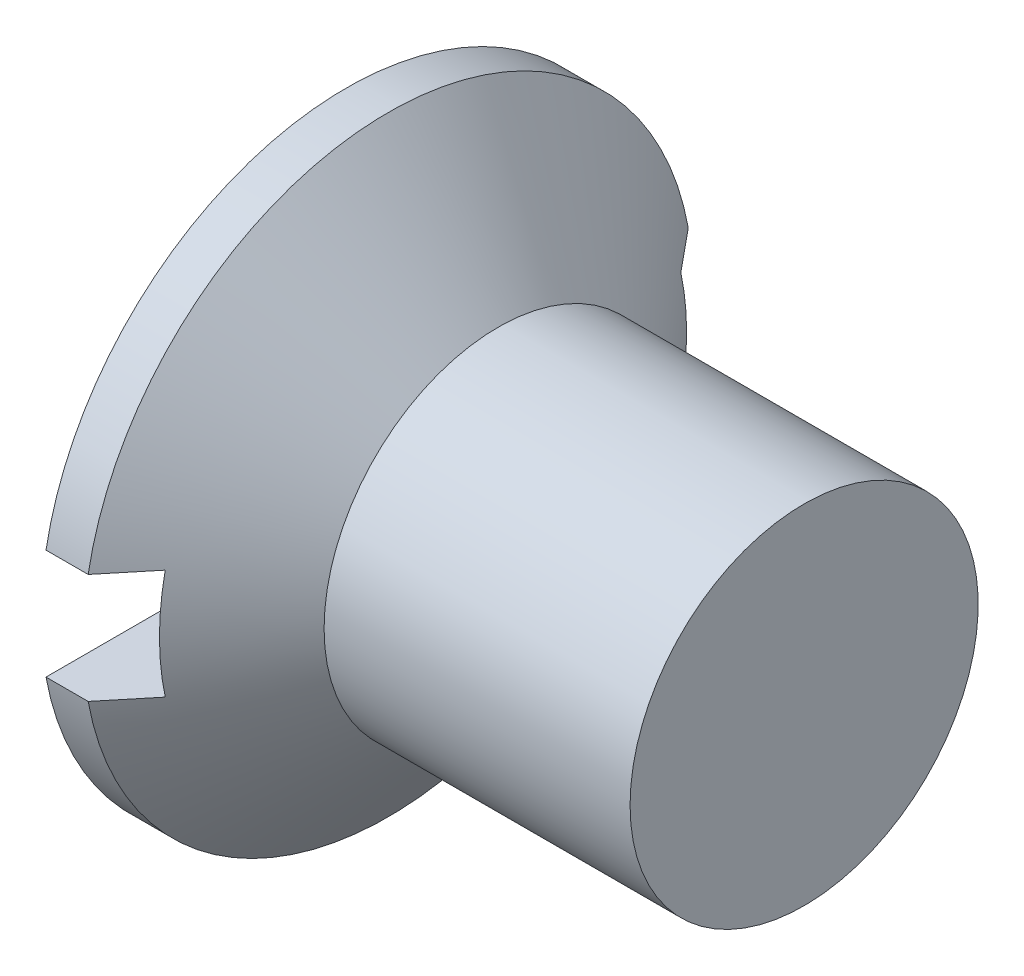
ISO-10303-21;
HEADER;
FILE_DESCRIPTION(('STEP AP214'),'2;1');
FILE_NAME('part.step','',(''),(''),'','','');
FILE_SCHEMA(('AUTOMOTIVE_DESIGN { 1 0 10303 214 1 1 1 1 }'));
ENDSEC;
DATA;
#1=APPLICATION_CONTEXT('core data for automotive mechanical design processes');
#2=APPLICATION_PROTOCOL_DEFINITION('international standard','automotive_design',2000,#1);
#3=PRODUCT_CONTEXT('',#1,'mechanical');
#4=PRODUCT('Part','Part','',(#3));
#5=PRODUCT_RELATED_PRODUCT_CATEGORY('part','',(#4));
#6=PRODUCT_DEFINITION_FORMATION('','',#4);
#7=PRODUCT_DEFINITION_CONTEXT('part definition',#1,'design');
#8=PRODUCT_DEFINITION('design','',#6,#7);
#9=PRODUCT_DEFINITION_SHAPE('','',#8);
#10=(LENGTH_UNIT() NAMED_UNIT(*) SI_UNIT(.MILLI.,.METRE.));
#11=(NAMED_UNIT(*) PLANE_ANGLE_UNIT() SI_UNIT($,.RADIAN.));
#12=(NAMED_UNIT(*) SI_UNIT($,.STERADIAN.) SOLID_ANGLE_UNIT());
#13=UNCERTAINTY_MEASURE_WITH_UNIT(LENGTH_MEASURE(1.E-05),#10,'distance_accuracy_value','');
#14=(GEOMETRIC_REPRESENTATION_CONTEXT(3) GLOBAL_UNCERTAINTY_ASSIGNED_CONTEXT((#13)) GLOBAL_UNIT_ASSIGNED_CONTEXT((#10,
#11,#12)) REPRESENTATION_CONTEXT('',''));
#15=CARTESIAN_POINT('',(0.,0.,0.));
#16=DIRECTION('',(0.,0.,1.));
#17=DIRECTION('',(1.,0.,0.));
#18=AXIS2_PLACEMENT_3D('',#15,#16,#17);
#19=CARTESIAN_POINT('',(1.0668,-0.762000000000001,-4.2291));
#20=DIRECTION('',(1.,0.,0.));
#21=DIRECTION('',(0.,0.,-1.));
#22=AXIS2_PLACEMENT_3D('',#19,#20,#21);
#23=PLANE('',#22);
#24=DIRECTION('',(0.,0.,1.));
#25=VECTOR('',#24,1.);
#26=CARTESIAN_POINT('',(1.0668,-0.457199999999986,-4.2291));
#27=LINE('',#26,#25);
#28=CARTESIAN_POINT('',(1.0668,-0.457200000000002,0.4572));
#29=VERTEX_POINT('',#28);
#30=CARTESIAN_POINT('',(1.0668,-0.457200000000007,2.11727142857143));
#31=VERTEX_POINT('',#30);
#32=EDGE_CURVE('E163',#29,#31,#27,.T.);
#33=ORIENTED_EDGE('',*,*,#32,.F.);
#34=DIRECTION('',(0.,1.,0.));
#35=VECTOR('',#34,1.);
#36=CARTESIAN_POINT('',(1.0668,-0.762,0.4572));
#37=LINE('',#36,#35);
#38=CARTESIAN_POINT('',(1.0668,-0.762000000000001,0.4572));
#39=VERTEX_POINT('',#38);
#40=EDGE_CURVE('E11',#39,#29,#37,.T.);
#41=ORIENTED_EDGE('',*,*,#40,.F.);
#42=DIRECTION('',(0.,0.,1.));
#43=VECTOR('',#42,1.);
#44=CARTESIAN_POINT('',(1.0668,-0.762000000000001,-4.2291));
#45=LINE('',#44,#43);
#46=CARTESIAN_POINT('',(1.0668,-0.762000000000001,3.57375793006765));
#47=VERTEX_POINT('',#46);
#48=EDGE_CURVE('E229',#39,#47,#45,.T.);
#49=ORIENTED_EDGE('',*,*,#48,.T.);
#50=CARTESIAN_POINT('',(1.0668,0.,0.));
#51=DIRECTION('',(1.,0.,0.));
#52=DIRECTION('',(0.,0.,-1.));
#53=AXIS2_PLACEMENT_3D('',#50,#51,#52);
#54=CIRCLE('',#53,3.65409219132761);
#55=CARTESIAN_POINT('',(1.0668,0.762,3.57375793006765));
#56=VERTEX_POINT('',#55);
#57=EDGE_CURVE('E265',#47,#56,#54,.F.);
#58=ORIENTED_EDGE('',*,*,#57,.T.);
#59=DIRECTION('',(0.,0.,-1.));
#60=VECTOR('',#59,1.);
#61=CARTESIAN_POINT('',(1.0668,0.762000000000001,4.2291));
#62=LINE('',#61,#60);
#63=CARTESIAN_POINT('',(1.0668,0.762000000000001,0.4572));
#64=VERTEX_POINT('',#63);
#65=EDGE_CURVE('E226',#56,#64,#62,.T.);
#66=ORIENTED_EDGE('',*,*,#65,.T.);
#67=CARTESIAN_POINT('',(1.0668,0.457199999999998,0.4572));
#68=VERTEX_POINT('',#67);
#69=EDGE_CURVE('E40',#68,#64,#37,.T.);
#70=ORIENTED_EDGE('',*,*,#69,.F.);
#71=DIRECTION('',(0.,0.,-1.));
#72=VECTOR('',#71,1.);
#73=CARTESIAN_POINT('',(1.0668,0.457200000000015,-4.2291));
#74=LINE('',#73,#72);
#75=CARTESIAN_POINT('',(1.0668,0.457199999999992,2.11727142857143));
#76=VERTEX_POINT('',#75);
#77=EDGE_CURVE('E373',#76,#68,#74,.T.);
#78=ORIENTED_EDGE('',*,*,#77,.F.);
#79=DIRECTION('',(0.,1.,0.));
#80=VECTOR('',#79,1.);
#81=CARTESIAN_POINT('',(1.0668,-0.762000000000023,2.11727142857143));
#82=LINE('',#81,#80);
#83=EDGE_CURVE('E317',#31,#76,#82,.T.);
#84=ORIENTED_EDGE('',*,*,#83,.F.);
#85=EDGE_LOOP('',(#33,#41,#49,#58,#66,#70,#78,#84));
#86=FACE_BOUND('',#85,.T.);
#87=ADVANCED_FACE('F32',(#86),#23,.F.);
#88=DIRECTION('',(0.,0.,1.));
#89=VECTOR('',#88,1.);
#90=CARTESIAN_POINT('',(1.0668,-0.457199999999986,-4.2291));
#91=LINE('',#90,#89);
#92=CARTESIAN_POINT('',(1.0668,-0.457199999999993,-2.11727142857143));
#93=VERTEX_POINT('',#92);
#94=CARTESIAN_POINT('',(1.0668,-0.457199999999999,-0.4572));
#95=VERTEX_POINT('',#94);
#96=EDGE_CURVE('E188',#93,#95,#91,.T.);
#97=ORIENTED_EDGE('',*,*,#96,.F.);
#98=DIRECTION('',(0.,-1.,0.));
#99=VECTOR('',#98,1.);
#100=CARTESIAN_POINT('',(1.0668,-0.762000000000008,-2.11727142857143));
#101=LINE('',#100,#99);
#102=CARTESIAN_POINT('',(1.0668,0.457200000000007,-2.11727142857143));
#103=VERTEX_POINT('',#102);
#104=EDGE_CURVE('E367',#103,#93,#101,.T.);
#105=ORIENTED_EDGE('',*,*,#104,.F.);
#106=DIRECTION('',(0.,0.,-1.));
#107=VECTOR('',#106,1.);
#108=CARTESIAN_POINT('',(1.0668,0.457200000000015,-4.2291));
#109=LINE('',#108,#107);
#110=CARTESIAN_POINT('',(1.0668,0.457200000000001,-0.4572));
#111=VERTEX_POINT('',#110);
#112=EDGE_CURVE('E378',#111,#103,#109,.T.);
#113=ORIENTED_EDGE('',*,*,#112,.F.);
#114=DIRECTION('',(0.,-1.,0.));
#115=VECTOR('',#114,1.);
#116=CARTESIAN_POINT('',(1.0668,-0.762000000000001,-0.4572));
#117=LINE('',#116,#115);
#118=CARTESIAN_POINT('',(1.0668,0.762,-0.4572));
#119=VERTEX_POINT('',#118);
#120=EDGE_CURVE('E348',#119,#111,#117,.T.);
#121=ORIENTED_EDGE('',*,*,#120,.F.);
#122=CARTESIAN_POINT('',(1.0668,0.762,-3.57375793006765));
#123=VERTEX_POINT('',#122);
#124=EDGE_CURVE('E54',#119,#123,#62,.T.);
#125=ORIENTED_EDGE('',*,*,#124,.T.);
#126=CARTESIAN_POINT('',(1.0668,-0.762000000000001,-3.57375793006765));
#127=VERTEX_POINT('',#126);
#128=EDGE_CURVE('E262',#123,#127,#54,.F.);
#129=ORIENTED_EDGE('',*,*,#128,.T.);
#130=CARTESIAN_POINT('',(1.0668,-0.762000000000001,-0.4572));
#131=VERTEX_POINT('',#130);
#132=EDGE_CURVE('E230',#127,#131,#45,.T.);
#133=ORIENTED_EDGE('',*,*,#132,.T.);
#134=EDGE_CURVE('E347',#95,#131,#117,.T.);
#135=ORIENTED_EDGE('',*,*,#134,.F.);
#136=EDGE_LOOP('',(#97,#105,#113,#121,#125,#129,#133,#135));
#137=FACE_BOUND('',#136,.T.);
#138=ADVANCED_FACE('F310',(#137),#23,.F.);
#139=CARTESIAN_POINT('',(4.11816176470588,0.,0.239245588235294));
#140=DIRECTION('',(-0.0712470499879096,0.,-0.997458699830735));
#141=DIRECTION('',(-0.997458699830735,0.,0.0712470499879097));
#142=AXIS2_PLACEMENT_3D('',#139,#140,#141);
#143=PLANE('',#142);
#144=ORIENTED_EDGE('',*,*,#40,.T.);
#145=DIRECTION('',(0.994936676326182,0.0710669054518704,-0.0710669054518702));
#146=VECTOR('',#145,1.);
#147=CARTESIAN_POINT('',(4.13507811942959,-0.238037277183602,0.238037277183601));
#148=LINE('',#147,#146);
#149=CARTESIAN_POINT('',(3.7338,-0.266700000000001,0.266699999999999));
#150=VERTEX_POINT('',#149);
#151=EDGE_CURVE('E161',#29,#150,#148,.T.);
#152=ORIENTED_EDGE('',*,*,#151,.T.);
#153=DIRECTION('',(0.820177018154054,0.569102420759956,-0.0585840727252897));
#154=VECTOR('',#153,1.);
#155=CARTESIAN_POINT('',(0.,-2.8575,0.533400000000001));
#156=LINE('',#155,#154);
#157=CARTESIAN_POINT('',(0.,-2.8575,0.533400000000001));
#158=VERTEX_POINT('',#157);
#159=EDGE_CURVE('E185',#158,#150,#156,.T.);
#160=ORIENTED_EDGE('',*,*,#159,.F.);
#161=DIRECTION('',(0.,-1.,0.));
#162=VECTOR('',#161,1.);
#163=CARTESIAN_POINT('',(0.,2.8575,0.5334));
#164=LINE('',#163,#162);
#165=CARTESIAN_POINT('',(0.,-0.762000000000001,0.5334));
#166=VERTEX_POINT('',#165);
#167=EDGE_CURVE('E324',#166,#158,#164,.T.);
#168=ORIENTED_EDGE('',*,*,#167,.F.);
#169=DIRECTION('',(0.997458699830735,0.,-0.0712470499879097));
#170=VECTOR('',#169,1.);
#171=CARTESIAN_POINT('',(1.39983654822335,-0.762000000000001,0.433411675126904));
#172=LINE('',#171,#170);
#173=EDGE_CURVE('E221',#166,#39,#172,.T.);
#174=ORIENTED_EDGE('',*,*,#173,.T.);
#175=EDGE_LOOP('',(#144,#152,#160,#168,#174));
#176=FACE_BOUND('',#175,.T.);
#177=ADVANCED_FACE('F183',(#176),#143,.T.);
#178=DIRECTION('',(0.820177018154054,-0.569102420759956,-0.0585840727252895));
#179=VECTOR('',#178,1.);
#180=CARTESIAN_POINT('',(0.,2.8575,0.5334));
#181=LINE('',#180,#179);
#182=CARTESIAN_POINT('',(0.,2.8575,0.5334));
#183=VERTEX_POINT('',#182);
#184=CARTESIAN_POINT('',(3.7338,0.2667,0.2667));
#185=VERTEX_POINT('',#184);
#186=EDGE_CURVE('E208',#183,#185,#181,.T.);
#187=ORIENTED_EDGE('',*,*,#186,.T.);
#188=DIRECTION('',(-0.994936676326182,0.0710669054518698,0.0710669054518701));
#189=VECTOR('',#188,1.);
#190=CARTESIAN_POINT('',(4.13507811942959,0.2380372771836,0.238037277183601));
#191=LINE('',#190,#189);
#192=EDGE_CURVE('E375',#185,#68,#191,.T.);
#193=ORIENTED_EDGE('',*,*,#192,.T.);
#194=ORIENTED_EDGE('',*,*,#69,.T.);
#195=DIRECTION('',(-0.997458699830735,0.,0.0712470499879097));
#196=VECTOR('',#195,1.);
#197=CARTESIAN_POINT('',(0.798746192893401,0.762,0.476346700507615));
#198=LINE('',#197,#196);
#199=CARTESIAN_POINT('',(0.,0.762,0.5334));
#200=VERTEX_POINT('',#199);
#201=EDGE_CURVE('E223',#64,#200,#198,.T.);
#202=ORIENTED_EDGE('',*,*,#201,.T.);
#203=EDGE_CURVE('E325',#183,#200,#164,.T.);
#204=ORIENTED_EDGE('',*,*,#203,.F.);
#205=EDGE_LOOP('',(#187,#193,#194,#202,#204));
#206=FACE_BOUND('',#205,.T.);
#207=ADVANCED_FACE('F411',(#206),#143,.T.);
#208=CARTESIAN_POINT('',(4.11816176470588,0.,-0.239245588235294));
#209=DIRECTION('',(-0.0712470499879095,0.,0.997458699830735));
#210=DIRECTION('',(0.997458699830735,0.,0.0712470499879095));
#211=AXIS2_PLACEMENT_3D('',#208,#209,#210);
#212=PLANE('',#211);
#213=DIRECTION('',(0.820177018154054,0.569102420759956,0.0585840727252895));
#214=VECTOR('',#213,1.);
#215=CARTESIAN_POINT('',(0.,-2.8575,-0.5334));
#216=LINE('',#215,#214);
#217=CARTESIAN_POINT('',(0.,-2.8575,-0.5334));
#218=VERTEX_POINT('',#217);
#219=CARTESIAN_POINT('',(3.7338,-0.2667,-0.2667));
#220=VERTEX_POINT('',#219);
#221=EDGE_CURVE('E203',#218,#220,#216,.T.);
#222=ORIENTED_EDGE('',*,*,#221,.T.);
#223=DIRECTION('',(-0.994936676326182,-0.0710669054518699,-0.07106690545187));
#224=VECTOR('',#223,1.);
#225=CARTESIAN_POINT('',(4.13507811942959,-0.2380372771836,-0.238037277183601));
#226=LINE('',#225,#224);
#227=EDGE_CURVE('E364',#220,#95,#226,.T.);
#228=ORIENTED_EDGE('',*,*,#227,.T.);
#229=ORIENTED_EDGE('',*,*,#134,.T.);
#230=DIRECTION('',(-0.997458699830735,0.,-0.0712470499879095));
#231=VECTOR('',#230,1.);
#232=CARTESIAN_POINT('',(0.798746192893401,-0.762000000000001,-0.476346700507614));
#233=LINE('',#232,#231);
#234=CARTESIAN_POINT('',(0.,-0.762000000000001,-0.5334));
#235=VERTEX_POINT('',#234);
#236=EDGE_CURVE('E218',#131,#235,#233,.T.);
#237=ORIENTED_EDGE('',*,*,#236,.T.);
#238=DIRECTION('',(0.,1.,0.));
#239=VECTOR('',#238,1.);
#240=CARTESIAN_POINT('',(0.,-2.8575,-0.5334));
#241=LINE('',#240,#239);
#242=EDGE_CURVE('E206',#218,#235,#241,.T.);
#243=ORIENTED_EDGE('',*,*,#242,.F.);
#244=EDGE_LOOP('',(#222,#228,#229,#237,#243));
#245=FACE_BOUND('',#244,.T.);
#246=ADVANCED_FACE('F361',(#245),#212,.T.);
#247=ORIENTED_EDGE('',*,*,#120,.T.);
#248=DIRECTION('',(0.994936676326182,-0.0710669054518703,0.07106690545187));
#249=VECTOR('',#248,1.);
#250=CARTESIAN_POINT('',(4.13507811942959,0.238037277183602,-0.238037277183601));
#251=LINE('',#250,#249);
#252=CARTESIAN_POINT('',(3.7338,0.266700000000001,-0.266699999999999));
#253=VERTEX_POINT('',#252);
#254=EDGE_CURVE('E380',#111,#253,#251,.T.);
#255=ORIENTED_EDGE('',*,*,#254,.T.);
#256=DIRECTION('',(0.820177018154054,-0.569102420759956,0.0585840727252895));
#257=VECTOR('',#256,1.);
#258=CARTESIAN_POINT('',(0.,2.8575,-0.533399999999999));
#259=LINE('',#258,#257);
#260=CARTESIAN_POINT('',(0.,2.8575,-0.533399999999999));
#261=VERTEX_POINT('',#260);
#262=EDGE_CURVE('E197',#261,#253,#259,.T.);
#263=ORIENTED_EDGE('',*,*,#262,.F.);
#264=CARTESIAN_POINT('',(0.,0.762,-0.5334));
#265=VERTEX_POINT('',#264);
#266=EDGE_CURVE('E202',#265,#261,#241,.T.);
#267=ORIENTED_EDGE('',*,*,#266,.F.);
#268=DIRECTION('',(0.997458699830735,0.,0.0712470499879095));
#269=VECTOR('',#268,1.);
#270=CARTESIAN_POINT('',(1.39983654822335,0.762,-0.433411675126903));
#271=LINE('',#270,#269);
#272=EDGE_CURVE('E47',#265,#119,#271,.T.);
#273=ORIENTED_EDGE('',*,*,#272,.T.);
#274=EDGE_LOOP('',(#247,#255,#263,#267,#273));
#275=FACE_BOUND('',#274,.T.);
#276=ADVANCED_FACE('F414',(#275),#212,.T.);
#277=CARTESIAN_POINT('',(0.,0.,0.));
#278=DIRECTION('',(-1.,0.,0.));
#279=DIRECTION('',(0.,0.,1.));
#280=AXIS2_PLACEMENT_3D('',#277,#278,#279);
#281=PLANE('',#280);
#282=DIRECTION('',(0.,0.,1.));
#283=VECTOR('',#282,1.);
#284=CARTESIAN_POINT('',(0.,2.8575,-0.533399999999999));
#285=LINE('',#284,#283);
#286=EDGE_CURVE('E321',#261,#183,#285,.T.);
#287=ORIENTED_EDGE('',*,*,#286,.T.);
#288=ORIENTED_EDGE('',*,*,#203,.T.);
#289=DIRECTION('',(0.,0.,-1.));
#290=VECTOR('',#289,1.);
#291=CARTESIAN_POINT('',(0.,0.762000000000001,4.2291));
#292=LINE('',#291,#290);
#293=CARTESIAN_POINT('',(0.,0.762000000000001,4.15988495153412));
#294=VERTEX_POINT('',#293);
#295=EDGE_CURVE('E234',#294,#200,#292,.T.);
#296=ORIENTED_EDGE('',*,*,#295,.F.);
#297=CARTESIAN_POINT('',(0.,0.,0.));
#298=DIRECTION('',(-1.,0.,0.));
#299=DIRECTION('',(0.,0.,1.));
#300=AXIS2_PLACEMENT_3D('',#297,#298,#299);
#301=CIRCLE('',#300,4.2291);
#302=CARTESIAN_POINT('',(0.,0.761999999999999,-4.15988495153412));
#303=VERTEX_POINT('',#302);
#304=EDGE_CURVE('E261',#294,#303,#301,.T.);
#305=ORIENTED_EDGE('',*,*,#304,.T.);
#306=EDGE_CURVE('E225',#265,#303,#292,.T.);
#307=ORIENTED_EDGE('',*,*,#306,.F.);
#308=ORIENTED_EDGE('',*,*,#266,.T.);
#309=EDGE_LOOP('',(#287,#288,#296,#305,#307,#308));
#310=FACE_BOUND('',#309,.T.);
#311=ADVANCED_FACE('F34',(#310),#281,.T.);
#312=DIRECTION('',(0.,0.,1.));
#313=VECTOR('',#312,1.);
#314=CARTESIAN_POINT('',(0.,-0.762000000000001,-4.2291));
#315=LINE('',#314,#313);
#316=CARTESIAN_POINT('',(0.,-0.762000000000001,4.15988495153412));
#317=VERTEX_POINT('',#316);
#318=EDGE_CURVE('E237',#166,#317,#315,.T.);
#319=ORIENTED_EDGE('',*,*,#318,.F.);
#320=ORIENTED_EDGE('',*,*,#167,.T.);
#321=DIRECTION('',(0.,0.,-1.));
#322=VECTOR('',#321,1.);
#323=CARTESIAN_POINT('',(0.,-2.8575,0.533400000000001));
#324=LINE('',#323,#322);
#325=EDGE_CURVE('E201',#158,#218,#324,.T.);
#326=ORIENTED_EDGE('',*,*,#325,.T.);
#327=ORIENTED_EDGE('',*,*,#242,.T.);
#328=CARTESIAN_POINT('',(0.,-0.762000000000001,-4.15988495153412));
#329=VERTEX_POINT('',#328);
#330=EDGE_CURVE('E238',#329,#235,#315,.T.);
#331=ORIENTED_EDGE('',*,*,#330,.F.);
#332=EDGE_CURVE('E258',#329,#317,#301,.T.);
#333=ORIENTED_EDGE('',*,*,#332,.T.);
#334=EDGE_LOOP('',(#319,#320,#326,#327,#331,#333));
#335=FACE_BOUND('',#334,.T.);
#336=ADVANCED_FACE('F295',(#335),#281,.T.);
#337=CARTESIAN_POINT('',(1.0668,0.762000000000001,4.2291));
#338=DIRECTION('',(0.,1.,0.));
#339=DIRECTION('',(0.,0.,1.));
#340=AXIS2_PLACEMENT_3D('',#337,#338,#339);
#341=PLANE('',#340);
#342=ORIENTED_EDGE('',*,*,#201,.F.);
#343=ORIENTED_EDGE('',*,*,#65,.F.);
#344=CARTESIAN_POINT('',(-3.7072587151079,0.761999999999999,-9.31247020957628));
#345=CARTESIAN_POINT('',(-3.44000396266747,0.761999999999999,-8.99289524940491));
#346=CARTESIAN_POINT('',(-3.17279503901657,0.761999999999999,-8.67328191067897));
#347=CARTESIAN_POINT('',(-2.63848754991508,0.761999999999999,-8.03388044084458));
#348=CARTESIAN_POINT('',(-2.37138900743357,0.761999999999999,-7.71409229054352));
#349=CARTESIAN_POINT('',(-1.83662954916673,0.761999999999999,-7.07341451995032));
#350=CARTESIAN_POINT('',(-1.56896924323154,0.761999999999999,-6.75252439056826));
#351=CARTESIAN_POINT('',(-1.03400782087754,0.761999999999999,-6.11052642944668));
#352=CARTESIAN_POINT('',(-0.766706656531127,0.761999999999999,-5.78941863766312));
#353=CARTESIAN_POINT('',(-0.351016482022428,0.761999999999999,-5.289228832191));
#354=CARTESIAN_POINT('',(-0.202447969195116,0.761999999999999,-5.11029601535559));
#355=CARTESIAN_POINT('',(0.0944702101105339,0.761999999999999,-4.75224397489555));
#356=CARTESIAN_POINT('',(0.242819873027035,0.761999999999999,-4.57312474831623));
#357=CARTESIAN_POINT('',(0.539280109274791,0.761999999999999,-4.21454388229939));
#358=CARTESIAN_POINT('',(0.687390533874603,0.761999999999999,-4.03508211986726));
#359=CARTESIAN_POINT('',(0.983148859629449,0.761999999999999,-3.6757952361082));
#360=CARTESIAN_POINT('',(1.1307967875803,0.762,-3.49597013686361));
#361=CARTESIAN_POINT('',(1.4250784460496,0.762,-3.1361172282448));
#362=CARTESIAN_POINT('',(1.57171364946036,0.762,-2.95609062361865));
#363=CARTESIAN_POINT('',(1.8638632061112,0.762,-2.5950604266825));
#364=CARTESIAN_POINT('',(2.00937730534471,0.762,-2.41405662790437));
#365=CARTESIAN_POINT('',(2.22594109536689,0.762,-2.14132570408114));
#366=CARTESIAN_POINT('',(2.29781283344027,0.762,-2.05025202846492));
#367=CARTESIAN_POINT('',(2.44075137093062,0.762,-1.8674759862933));
#368=CARTESIAN_POINT('',(2.51181818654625,0.762,-1.77577363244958));
#369=CARTESIAN_POINT('',(2.65270923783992,0.762,-1.59146944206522));
#370=CARTESIAN_POINT('',(2.72253390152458,0.762,-1.49886793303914));
#371=CARTESIAN_POINT('',(2.86023102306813,0.762,-1.31222787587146));
#372=CARTESIAN_POINT('',(2.92810378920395,0.762,-1.2181895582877));
#373=CARTESIAN_POINT('',(3.01025299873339,0.762,-1.09986139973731));
#374=CARTESIAN_POINT('',(3.02617193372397,0.762,-1.07671297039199));
#375=CARTESIAN_POINT('',(3.05776361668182,0.762,-1.03024803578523));
#376=CARTESIAN_POINT('',(3.07343635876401,0.762,-1.0069315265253));
#377=CARTESIAN_POINT('',(3.12003064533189,0.762,-0.936688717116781));
#378=CARTESIAN_POINT('',(3.15052357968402,0.762,-0.889475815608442));
#379=CARTESIAN_POINT('',(3.20988876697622,0.762,-0.79404861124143));
#380=CARTESIAN_POINT('',(3.23876139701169,0.762,-0.745834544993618));
#381=CARTESIAN_POINT('',(3.29412788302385,0.762,-0.648063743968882));
#382=CARTESIAN_POINT('',(3.32062251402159,0.762,-0.598507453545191));
#383=CARTESIAN_POINT('',(3.37465775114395,0.762,-0.488263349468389));
#384=CARTESIAN_POINT('',(3.40148165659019,0.762,-0.427215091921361));
#385=CARTESIAN_POINT('',(3.44672648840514,0.762,-0.302131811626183));
#386=CARTESIAN_POINT('',(3.46518411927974,0.762,-0.238111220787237));
#387=CARTESIAN_POINT('',(3.48225148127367,0.762,-0.146253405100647));
#388=CARTESIAN_POINT('',(3.48614457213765,0.762,-0.119389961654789));
#389=CARTESIAN_POINT('',(3.49159277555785,0.762,-0.0654330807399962));
#390=CARTESIAN_POINT('',(3.49314897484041,0.762,-0.038339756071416));
#391=CARTESIAN_POINT('',(3.49381884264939,0.762,0.0158555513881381));
#392=CARTESIAN_POINT('',(3.49293454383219,0.762,0.0429575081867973));
#393=CARTESIAN_POINT('',(3.48879300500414,0.762,0.0969771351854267));
#394=CARTESIAN_POINT('',(3.48553530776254,0.762,0.123894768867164));
#395=CARTESIAN_POINT('',(3.46943887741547,0.762,0.222717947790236));
#396=CARTESIAN_POINT('',(3.44971992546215,0.762,0.293536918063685));
#397=CARTESIAN_POINT('',(3.41248463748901,0.762,0.396952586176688));
#398=CARTESIAN_POINT('',(3.39872406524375,0.762,0.431090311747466));
#399=CARTESIAN_POINT('',(3.36925376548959,0.762,0.498521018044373));
#400=CARTESIAN_POINT('',(3.35354458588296,0.762,0.531814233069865));
#401=CARTESIAN_POINT('',(3.31943027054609,0.762,0.600099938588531));
#402=CARTESIAN_POINT('',(3.30091151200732,0.762,0.635034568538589));
#403=CARTESIAN_POINT('',(3.26259798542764,0.762,0.704200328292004));
#404=CARTESIAN_POINT('',(3.24280301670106,0.762,0.738431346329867));
#405=CARTESIAN_POINT('',(3.18195487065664,0.762,0.840317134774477));
#406=CARTESIAN_POINT('',(3.13946655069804,0.762,0.907110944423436));
#407=CARTESIAN_POINT('',(3.05209649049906,0.762,1.03933825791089));
#408=CARTESIAN_POINT('',(3.0072087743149,0.762,1.10476774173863));
#409=CARTESIAN_POINT('',(2.91593893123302,0.762,1.23458285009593));
#410=CARTESIAN_POINT('',(2.86955664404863,0.762,1.29896836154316));
#411=CARTESIAN_POINT('',(2.77564303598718,0.762,1.42719101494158));
#412=CARTESIAN_POINT('',(2.72810866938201,0.762,1.49102591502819));
#413=CARTESIAN_POINT('',(2.63231739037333,0.762,1.61816085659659));
#414=CARTESIAN_POINT('',(2.58406040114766,0.762,1.68146084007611));
#415=CARTESIAN_POINT('',(2.48711166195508,0.762,1.80754005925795));
#416=CARTESIAN_POINT('',(2.4384208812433,0.762,1.8703200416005));
#417=CARTESIAN_POINT('',(2.34064642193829,0.762,1.99556913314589));
#418=CARTESIAN_POINT('',(2.2915627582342,0.762,2.05803825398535));
#419=CARTESIAN_POINT('',(2.14505428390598,0.762,2.24357793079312));
#420=CARTESIAN_POINT('',(2.04719301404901,0.762,2.36630365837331));
#421=CARTESIAN_POINT('',(1.8507288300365,0.762,2.61116041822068));
#422=CARTESIAN_POINT('',(1.75212590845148,0.762,2.73329144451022));
#423=CARTESIAN_POINT('',(1.45557279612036,0.762,3.09909678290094));
#424=CARTESIAN_POINT('',(1.2568860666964,0.762,3.34217356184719));
#425=CARTESIAN_POINT('',(0.858371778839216,0.762,3.82769147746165));
#426=CARTESIAN_POINT('',(0.658543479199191,0.762000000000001,4.07013200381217));
#427=CARTESIAN_POINT('',(0.258296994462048,0.762000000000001,4.55451731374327));
#428=CARTESIAN_POINT('',(0.0578788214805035,0.762000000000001,4.79646210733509));
#429=CARTESIAN_POINT('',(-0.342651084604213,0.762000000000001,5.27922139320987));
#430=CARTESIAN_POINT('',(-0.542761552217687,0.762000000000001,5.52003693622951));
#431=CARTESIAN_POINT('',(-0.943235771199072,0.762000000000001,6.0014594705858));
#432=CARTESIAN_POINT('',(-1.14359952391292,0.762000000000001,6.24206646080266));
#433=CARTESIAN_POINT('',(-1.74487446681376,0.762000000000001,6.96357581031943));
#434=CARTESIAN_POINT('',(-2.14604716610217,0.762000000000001,7.44426021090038));
#435=CARTESIAN_POINT('',(-2.64396767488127,0.762000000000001,8.04039269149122));
#436=CARTESIAN_POINT('',(-2.74053815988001,0.762000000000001,8.15598900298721));
#437=CARTESIAN_POINT('',(-2.93370243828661,0.762000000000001,8.38716828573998));
#438=CARTESIAN_POINT('',(-3.03029623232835,0.762000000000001,8.50275125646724));
#439=CARTESIAN_POINT('',(-3.22361055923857,0.762000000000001,8.73403297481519));
#440=CARTESIAN_POINT('',(-3.3203311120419,0.762000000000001,8.84973170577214));
#441=CARTESIAN_POINT('',(-3.51378501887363,0.762000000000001,9.08111230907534));
#442=CARTESIAN_POINT('',(-3.61051837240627,0.762000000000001,9.19679418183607));
#443=CARTESIAN_POINT('',(-3.7072587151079,0.762000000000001,9.31247020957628));
#444=B_SPLINE_CURVE_WITH_KNOTS('',3,(#344,#345,#346,#347,#348,#349,#350,#351,#352,#353,#354,
#355,#356,#357,#358,#359,#360,#361,#362,#363,#364,#365,#366,#367,#368,#369,#370,#371,#372,#373,
#374,#375,#376,#377,#378,#379,#380,#381,#382,#383,#384,#385,#386,#387,#388,#389,#390,#391,#392,
#393,#394,#395,#396,#397,#398,#399,#400,#401,#402,#403,#404,#405,#406,#407,#408,#409,#410,#411,
#412,#413,#414,#415,#416,#417,#418,#419,#420,#421,#422,#423,#424,#425,#426,#427,#428,#429,#430,
#431,#432,#433,#434,#435,#436,#437,#438,#439,#440,#441,#442,#443),.UNSPECIFIED.,.F.,.F.,(4,2,2,
2,2,2,2,2,2,2,2,2,2,2,2,2,2,2,2,2,2,2,2,2,2,2,2,2,2,2,2,2,2,2,2,2,2,2,2,2,2,2,2,2,2,2,2,2,2,4),
(0.,1.24979177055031,2.49977364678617,3.75337340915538,5.00678480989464,5.70449953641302,
6.40222549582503,7.10028597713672,7.79830523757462,8.49486886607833,9.19158592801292,
9.53963455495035,9.88767616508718,10.2355954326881,10.5834594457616,10.6677394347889,
10.7520214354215,10.9206098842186,11.0891589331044,11.2576528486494,11.4573840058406,
11.6562302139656,11.7375735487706,11.8188790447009,11.9001168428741,11.9813702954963,
12.2003589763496,12.3107660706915,12.4211421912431,12.5397301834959,12.6583368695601,
12.8957317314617,13.1337482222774,13.3717903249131,13.6105509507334,13.8493371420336,
14.0876816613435,14.3260171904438,14.7969108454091,15.2678092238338,16.2096435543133,
17.1521812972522,18.0946998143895,19.0340222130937,19.9733496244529,21.8516391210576,
22.3035188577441,22.7554127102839,23.207816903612,23.6602069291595),.UNSPECIFIED.);
#445=CARTESIAN_POINT('',(0.584311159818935,0.762000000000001,4.15988495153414));
#446=VERTEX_POINT('',#445);
#447=EDGE_CURVE('E341',#56,#446,#444,.T.);
#448=ORIENTED_EDGE('',*,*,#447,.T.);
#449=DIRECTION('',(-1.,0.,0.));
#450=VECTOR('',#449,1.);
#451=CARTESIAN_POINT('',(-6.34999999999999,0.762000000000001,4.15988495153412));
#452=LINE('',#451,#450);
#453=EDGE_CURVE('E244',#446,#294,#452,.T.);
#454=ORIENTED_EDGE('',*,*,#453,.T.);
#455=ORIENTED_EDGE('',*,*,#295,.T.);
#456=EDGE_LOOP('',(#342,#343,#448,#454,#455));
#457=FACE_BOUND('',#456,.T.);
#458=ADVANCED_FACE('F291',(#457),#341,.F.);
#459=ORIENTED_EDGE('',*,*,#272,.F.);
#460=ORIENTED_EDGE('',*,*,#306,.T.);
#461=DIRECTION('',(-1.,0.,0.));
#462=VECTOR('',#461,1.);
#463=CARTESIAN_POINT('',(-6.34999999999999,0.761999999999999,-4.15988495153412));
#464=LINE('',#463,#462);
#465=CARTESIAN_POINT('',(0.584311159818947,0.761999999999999,-4.15988495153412));
#466=VERTEX_POINT('',#465);
#467=EDGE_CURVE('E246',#303,#466,#464,.F.);
#468=ORIENTED_EDGE('',*,*,#467,.T.);
#469=EDGE_CURVE('E273',#466,#123,#444,.T.);
#470=ORIENTED_EDGE('',*,*,#469,.T.);
#471=ORIENTED_EDGE('',*,*,#124,.F.);
#472=EDGE_LOOP('',(#459,#460,#468,#470,#471));
#473=FACE_BOUND('',#472,.T.);
#474=ADVANCED_FACE('F288',(#473),#341,.F.);
#475=CARTESIAN_POINT('',(1.0668,-0.762000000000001,-4.2291));
#476=DIRECTION('',(0.,-1.,0.));
#477=DIRECTION('',(0.,0.,-1.));
#478=AXIS2_PLACEMENT_3D('',#475,#476,#477);
#479=PLANE('',#478);
#480=ORIENTED_EDGE('',*,*,#173,.F.);
#481=ORIENTED_EDGE('',*,*,#318,.T.);
#482=DIRECTION('',(-1.,0.,0.));
#483=VECTOR('',#482,1.);
#484=CARTESIAN_POINT('',(-6.34999999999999,-0.762000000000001,4.15988495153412));
#485=LINE('',#484,#483);
#486=CARTESIAN_POINT('',(0.584311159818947,-0.762000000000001,4.15988495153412));
#487=VERTEX_POINT('',#486);
#488=EDGE_CURVE('E242',#317,#487,#485,.F.);
#489=ORIENTED_EDGE('',*,*,#488,.T.);
#490=CARTESIAN_POINT('',(-3.7072587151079,-0.762,9.31247020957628));
#491=CARTESIAN_POINT('',(-3.44000396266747,-0.762,8.99289524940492));
#492=CARTESIAN_POINT('',(-3.17279503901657,-0.762,8.67328191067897));
#493=CARTESIAN_POINT('',(-2.63848754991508,-0.762,8.03388044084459));
#494=CARTESIAN_POINT('',(-2.37138900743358,-0.762,7.71409229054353));
#495=CARTESIAN_POINT('',(-1.83662954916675,-0.762,7.07341451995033));
#496=CARTESIAN_POINT('',(-1.56896924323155,-0.762,6.75252439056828));
#497=CARTESIAN_POINT('',(-1.03400782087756,-0.762,6.1105264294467));
#498=CARTESIAN_POINT('',(-0.766706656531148,-0.762000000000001,5.78941863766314));
#499=CARTESIAN_POINT('',(-0.351016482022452,-0.762000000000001,5.28922883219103));
#500=CARTESIAN_POINT('',(-0.202447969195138,-0.762000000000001,5.11029601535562));
#501=CARTESIAN_POINT('',(0.0944702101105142,-0.762000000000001,4.75224397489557));
#502=CARTESIAN_POINT('',(0.242819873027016,-0.762000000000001,4.57312474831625));
#503=CARTESIAN_POINT('',(0.539280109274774,-0.762000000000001,4.21454388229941));
#504=CARTESIAN_POINT('',(0.687390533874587,-0.762000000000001,4.03508211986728));
#505=CARTESIAN_POINT('',(0.983148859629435,-0.762000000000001,3.67579523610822));
#506=CARTESIAN_POINT('',(1.13079678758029,-0.762000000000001,3.49597013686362));
#507=CARTESIAN_POINT('',(1.42507844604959,-0.762000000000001,3.13611722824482));
#508=CARTESIAN_POINT('',(1.57171364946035,-0.762000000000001,2.95609062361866));
#509=CARTESIAN_POINT('',(1.86386320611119,-0.762000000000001,2.59506042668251));
#510=CARTESIAN_POINT('',(2.0093773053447,-0.762,2.41405662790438));
#511=CARTESIAN_POINT('',(2.22594109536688,-0.762000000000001,2.14132570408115));
#512=CARTESIAN_POINT('',(2.29781283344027,-0.762000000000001,2.05025202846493));
#513=CARTESIAN_POINT('',(2.44075137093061,-0.762000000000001,1.86747598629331));
#514=CARTESIAN_POINT('',(2.51181818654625,-0.762000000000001,1.77577363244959));
#515=CARTESIAN_POINT('',(2.65270923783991,-0.762000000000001,1.59146944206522));
#516=CARTESIAN_POINT('',(2.72253390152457,-0.762000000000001,1.49886793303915));
#517=CARTESIAN_POINT('',(2.86023102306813,-0.762000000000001,1.31222787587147));
#518=CARTESIAN_POINT('',(2.92810378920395,-0.762000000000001,1.2181895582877));
#519=CARTESIAN_POINT('',(3.01025299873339,-0.762000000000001,1.09986139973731));
#520=CARTESIAN_POINT('',(3.02617193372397,-0.762000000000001,1.07671297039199));
#521=CARTESIAN_POINT('',(3.05776361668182,-0.762000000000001,1.03024803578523));
#522=CARTESIAN_POINT('',(3.07343635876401,-0.762000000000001,1.00693152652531));
#523=CARTESIAN_POINT('',(3.12003064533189,-0.762000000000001,0.936688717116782));
#524=CARTESIAN_POINT('',(3.15052357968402,-0.762000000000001,0.889475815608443));
#525=CARTESIAN_POINT('',(3.20988876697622,-0.762000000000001,0.79404861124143));
#526=CARTESIAN_POINT('',(3.23876139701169,-0.762000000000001,0.745834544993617));
#527=CARTESIAN_POINT('',(3.29412788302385,-0.762000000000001,0.648063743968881));
#528=CARTESIAN_POINT('',(3.32062251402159,-0.762000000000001,0.59850745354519));
#529=CARTESIAN_POINT('',(3.37465775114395,-0.762000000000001,0.488263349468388));
#530=CARTESIAN_POINT('',(3.40148165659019,-0.762000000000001,0.427215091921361));
#531=CARTESIAN_POINT('',(3.44672648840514,-0.762000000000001,0.302131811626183));
#532=CARTESIAN_POINT('',(3.46518411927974,-0.762000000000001,0.238111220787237));
#533=CARTESIAN_POINT('',(3.48225148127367,-0.762000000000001,0.146253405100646));
#534=CARTESIAN_POINT('',(3.48614457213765,-0.762000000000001,0.119389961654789));
#535=CARTESIAN_POINT('',(3.49159277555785,-0.762000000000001,0.0654330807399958));
#536=CARTESIAN_POINT('',(3.49314897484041,-0.762000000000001,0.0383397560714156));
#537=CARTESIAN_POINT('',(3.49381884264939,-0.762000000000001,-0.0158555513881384));
#538=CARTESIAN_POINT('',(3.49293454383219,-0.762000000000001,-0.0429575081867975));
#539=CARTESIAN_POINT('',(3.48879300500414,-0.762000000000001,-0.096977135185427));
#540=CARTESIAN_POINT('',(3.48553530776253,-0.762000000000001,-0.123894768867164));
#541=CARTESIAN_POINT('',(3.46943887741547,-0.762000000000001,-0.222717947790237));
#542=CARTESIAN_POINT('',(3.44971992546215,-0.762000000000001,-0.293536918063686));
#543=CARTESIAN_POINT('',(3.41248463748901,-0.762000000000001,-0.396952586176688));
#544=CARTESIAN_POINT('',(3.39872406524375,-0.762000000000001,-0.431090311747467));
#545=CARTESIAN_POINT('',(3.36925376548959,-0.762000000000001,-0.498521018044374));
#546=CARTESIAN_POINT('',(3.35354458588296,-0.762000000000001,-0.531814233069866));
#547=CARTESIAN_POINT('',(3.31943027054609,-0.762000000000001,-0.600099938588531));
#548=CARTESIAN_POINT('',(3.30091151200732,-0.762000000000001,-0.63503456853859));
#549=CARTESIAN_POINT('',(3.26259798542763,-0.762000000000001,-0.704200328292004));
#550=CARTESIAN_POINT('',(3.24280301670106,-0.762000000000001,-0.738431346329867));
#551=CARTESIAN_POINT('',(3.18195487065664,-0.762000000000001,-0.840317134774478));
#552=CARTESIAN_POINT('',(3.13946655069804,-0.762000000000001,-0.907110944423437));
#553=CARTESIAN_POINT('',(3.05209649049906,-0.762000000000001,-1.03933825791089));
#554=CARTESIAN_POINT('',(3.0072087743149,-0.762000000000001,-1.10476774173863));
#555=CARTESIAN_POINT('',(2.91593893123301,-0.762000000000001,-1.23458285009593));
#556=CARTESIAN_POINT('',(2.86955664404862,-0.762000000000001,-1.29896836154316));
#557=CARTESIAN_POINT('',(2.77564303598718,-0.762000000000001,-1.42719101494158));
#558=CARTESIAN_POINT('',(2.72810866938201,-0.762000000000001,-1.49102591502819));
#559=CARTESIAN_POINT('',(2.63231739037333,-0.762000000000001,-1.6181608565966));
#560=CARTESIAN_POINT('',(2.58406040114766,-0.762000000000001,-1.68146084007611));
#561=CARTESIAN_POINT('',(2.48711166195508,-0.762000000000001,-1.80754005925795));
#562=CARTESIAN_POINT('',(2.4384208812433,-0.762000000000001,-1.87032004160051));
#563=CARTESIAN_POINT('',(2.34064642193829,-0.762000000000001,-1.9955691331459));
#564=CARTESIAN_POINT('',(2.2915627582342,-0.762000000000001,-2.05803825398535));
#565=CARTESIAN_POINT('',(2.14505428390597,-0.762000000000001,-2.24357793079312));
#566=CARTESIAN_POINT('',(2.04719301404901,-0.762000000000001,-2.36630365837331));
#567=CARTESIAN_POINT('',(1.85072883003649,-0.762000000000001,-2.61116041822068));
#568=CARTESIAN_POINT('',(1.75212590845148,-0.762000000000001,-2.73329144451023));
#569=CARTESIAN_POINT('',(1.45557279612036,-0.762000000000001,-3.09909678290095));
#570=CARTESIAN_POINT('',(1.25688606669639,-0.762000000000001,-3.34217356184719));
#571=CARTESIAN_POINT('',(0.85837177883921,-0.762000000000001,-3.82769147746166));
#572=CARTESIAN_POINT('',(0.658543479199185,-0.762000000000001,-4.07013200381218));
#573=CARTESIAN_POINT('',(0.258296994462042,-0.762000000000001,-4.55451731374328));
#574=CARTESIAN_POINT('',(0.0578788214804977,-0.762000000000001,-4.7964621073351));
#575=CARTESIAN_POINT('',(-0.34265108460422,-0.762000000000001,-5.27922139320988));
#576=CARTESIAN_POINT('',(-0.542761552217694,-0.762000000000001,-5.52003693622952));
#577=CARTESIAN_POINT('',(-0.943235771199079,-0.762000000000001,-6.00145947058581));
#578=CARTESIAN_POINT('',(-1.14359952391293,-0.762000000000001,-6.24206646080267));
#579=CARTESIAN_POINT('',(-1.74487446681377,-0.762000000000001,-6.96357581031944));
#580=CARTESIAN_POINT('',(-2.14604716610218,-0.762000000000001,-7.44426021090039));
#581=CARTESIAN_POINT('',(-2.64396767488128,-0.762000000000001,-8.04039269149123));
#582=CARTESIAN_POINT('',(-2.74053815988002,-0.762000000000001,-8.15598900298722));
#583=CARTESIAN_POINT('',(-2.93370243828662,-0.762000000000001,-8.38716828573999));
#584=CARTESIAN_POINT('',(-3.03029623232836,-0.762000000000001,-8.50275125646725));
#585=CARTESIAN_POINT('',(-3.22361055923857,-0.762000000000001,-8.7340329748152));
#586=CARTESIAN_POINT('',(-3.32033111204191,-0.762000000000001,-8.84973170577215));
#587=CARTESIAN_POINT('',(-3.51378501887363,-0.762000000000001,-9.08111230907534));
#588=CARTESIAN_POINT('',(-3.61051837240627,-0.762000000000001,-9.19679418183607));
#589=CARTESIAN_POINT('',(-3.7072587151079,-0.762000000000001,-9.31247020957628));
#590=B_SPLINE_CURVE_WITH_KNOTS('',3,(#490,#491,#492,#493,#494,#495,#496,#497,#498,#499,#500,
#501,#502,#503,#504,#505,#506,#507,#508,#509,#510,#511,#512,#513,#514,#515,#516,#517,#518,#519,
#520,#521,#522,#523,#524,#525,#526,#527,#528,#529,#530,#531,#532,#533,#534,#535,#536,#537,#538,
#539,#540,#541,#542,#543,#544,#545,#546,#547,#548,#549,#550,#551,#552,#553,#554,#555,#556,#557,
#558,#559,#560,#561,#562,#563,#564,#565,#566,#567,#568,#569,#570,#571,#572,#573,#574,#575,#576,
#577,#578,#579,#580,#581,#582,#583,#584,#585,#586,#587,#588,#589),.UNSPECIFIED.,.F.,.F.,(4,2,2,
2,2,2,2,2,2,2,2,2,2,2,2,2,2,2,2,2,2,2,2,2,2,2,2,2,2,2,2,2,2,2,2,2,2,2,2,2,2,2,2,2,2,2,2,2,2,4),
(0.,1.2497917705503,2.49977364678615,3.75337340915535,5.0067848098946,5.70449953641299,
6.402225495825,7.10028597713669,7.7983052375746,8.49486886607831,9.19158592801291,
9.53963455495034,9.88767616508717,10.2355954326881,10.5834594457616,10.6677394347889,
10.7520214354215,10.9206098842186,11.0891589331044,11.2576528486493,11.4573840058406,
11.6562302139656,11.7375735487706,11.8188790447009,11.9001168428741,11.9813702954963,
12.2003589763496,12.3107660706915,12.4211421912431,12.5397301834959,12.65833686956,
12.8957317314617,13.1337482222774,13.3717903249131,13.6105509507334,13.8493371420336,
14.0876816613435,14.3260171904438,14.7969108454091,15.2678092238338,16.2096435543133,
17.1521812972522,18.0946998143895,19.0340222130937,19.9733496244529,21.8516391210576,
22.3035188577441,22.7554127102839,23.207816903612,23.6602069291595),.UNSPECIFIED.);
#591=EDGE_CURVE('E274',#487,#47,#590,.T.);
#592=ORIENTED_EDGE('',*,*,#591,.T.);
#593=ORIENTED_EDGE('',*,*,#48,.F.);
#594=EDGE_LOOP('',(#480,#481,#489,#592,#593));
#595=FACE_BOUND('',#594,.T.);
#596=ADVANCED_FACE('F283',(#595),#479,.F.);
#597=ORIENTED_EDGE('',*,*,#236,.F.);
#598=ORIENTED_EDGE('',*,*,#132,.F.);
#599=CARTESIAN_POINT('',(0.584311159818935,-0.762000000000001,-4.15988495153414));
#600=VERTEX_POINT('',#599);
#601=EDGE_CURVE('E264',#127,#600,#590,.T.);
#602=ORIENTED_EDGE('',*,*,#601,.T.);
#603=DIRECTION('',(-1.,0.,0.));
#604=VECTOR('',#603,1.);
#605=CARTESIAN_POINT('',(-6.34999999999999,-0.762000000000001,-4.15988495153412));
#606=LINE('',#605,#604);
#607=EDGE_CURVE('E233',#600,#329,#606,.T.);
#608=ORIENTED_EDGE('',*,*,#607,.T.);
#609=ORIENTED_EDGE('',*,*,#330,.T.);
#610=EDGE_LOOP('',(#597,#598,#602,#608,#609));
#611=FACE_BOUND('',#610,.T.);
#612=ADVANCED_FACE('F287',(#611),#479,.F.);
#613=CARTESIAN_POINT('',(-6.34999999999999,0.,0.));
#614=DIRECTION('',(-1.,0.,0.));
#615=DIRECTION('',(0.,0.,1.));
#616=AXIS2_PLACEMENT_3D('',#613,#614,#615);
#617=CYLINDRICAL_SURFACE('',#616,4.2291);
#618=ORIENTED_EDGE('',*,*,#467,.F.);
#619=ORIENTED_EDGE('',*,*,#304,.F.);
#620=ORIENTED_EDGE('',*,*,#453,.F.);
#621=CARTESIAN_POINT('',(0.584311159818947,0.,0.));
#622=DIRECTION('',(-1.,0.,0.));
#623=DIRECTION('',(0.,0.,1.));
#624=AXIS2_PLACEMENT_3D('',#621,#622,#623);
#625=CIRCLE('',#624,4.2291);
#626=EDGE_CURVE('E257',#446,#466,#625,.T.);
#627=ORIENTED_EDGE('',*,*,#626,.T.);
#628=EDGE_LOOP('',(#618,#619,#620,#627));
#629=FACE_BOUND('',#628,.T.);
#630=ADVANCED_FACE('F474',(#629),#617,.T.);
#631=ORIENTED_EDGE('',*,*,#488,.F.);
#632=ORIENTED_EDGE('',*,*,#332,.F.);
#633=ORIENTED_EDGE('',*,*,#607,.F.);
#634=EDGE_CURVE('E254',#600,#487,#625,.T.);
#635=ORIENTED_EDGE('',*,*,#634,.T.);
#636=EDGE_LOOP('',(#631,#632,#633,#635));
#637=FACE_BOUND('',#636,.T.);
#638=ADVANCED_FACE('F306',(#637),#617,.T.);
#639=CARTESIAN_POINT('',(0.584311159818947,0.,0.));
#640=DIRECTION('',(-1.,0.,0.));
#641=DIRECTION('',(0.,0.,1.));
#642=AXIS2_PLACEMENT_3D('',#639,#640,#641);
#643=CONICAL_SURFACE('',#642,4.2291,0.872664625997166);
#644=ORIENTED_EDGE('',*,*,#447,.F.);
#645=ORIENTED_EDGE('',*,*,#57,.F.);
#646=ORIENTED_EDGE('',*,*,#591,.F.);
#647=ORIENTED_EDGE('',*,*,#634,.F.);
#648=ORIENTED_EDGE('',*,*,#601,.F.);
#649=ORIENTED_EDGE('',*,*,#128,.F.);
#650=ORIENTED_EDGE('',*,*,#469,.F.);
#651=ORIENTED_EDGE('',*,*,#626,.F.);
#652=EDGE_LOOP('',(#644,#645,#646,#647,#648,#649,#650,#651));
#653=FACE_BOUND('',#652,.T.);
#654=CARTESIAN_POINT('',(2.1082,0.,0.));
#655=DIRECTION('',(-1.,0.,0.));
#656=DIRECTION('',(0.,0.,1.));
#657=AXIS2_PLACEMENT_3D('',#654,#655,#656);
#658=CIRCLE('',#657,2.413);
#659=CARTESIAN_POINT('',(2.1082,0.,2.413));
#660=VERTEX_POINT('',#659);
#661=EDGE_CURVE('E251',#660,#660,#658,.T.);
#662=ORIENTED_EDGE('',*,*,#661,.T.);
#663=EDGE_LOOP('',(#662));
#664=FACE_BOUND('',#663,.T.);
#665=ADVANCED_FACE('F280',(#653,#664),#643,.T.);
#666=CARTESIAN_POINT('',(-6.34999999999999,0.,0.));
#667=DIRECTION('',(-1.,0.,0.));
#668=DIRECTION('',(0.,0.,1.));
#669=AXIS2_PLACEMENT_3D('',#666,#667,#668);
#670=CYLINDRICAL_SURFACE('',#669,2.413);
#671=CARTESIAN_POINT('',(6.35,0.,0.));
#672=DIRECTION('',(-1.,0.,0.));
#673=DIRECTION('',(0.,0.,1.));
#674=AXIS2_PLACEMENT_3D('',#671,#672,#673);
#675=CIRCLE('',#674,2.413);
#676=CARTESIAN_POINT('',(6.35,0.,2.413));
#677=VERTEX_POINT('',#676);
#678=EDGE_CURVE('E248',#677,#677,#675,.T.);
#679=ORIENTED_EDGE('',*,*,#678,.T.);
#680=EDGE_LOOP('',(#679));
#681=FACE_BOUND('',#680,.T.);
#682=ORIENTED_EDGE('',*,*,#661,.F.);
#683=EDGE_LOOP('',(#682));
#684=FACE_BOUND('',#683,.T.);
#685=ADVANCED_FACE('F299',(#681,#684),#670,.T.);
#686=CARTESIAN_POINT('',(6.35,2.413,0.));
#687=DIRECTION('',(1.,0.,0.));
#688=DIRECTION('',(0.,0.,-1.));
#689=AXIS2_PLACEMENT_3D('',#686,#687,#688);
#690=PLANE('',#689);
#691=ORIENTED_EDGE('',*,*,#678,.F.);
#692=EDGE_LOOP('',(#691));
#693=FACE_BOUND('',#692,.T.);
#694=ADVANCED_FACE('F297',(#693),#690,.T.);
#695=CARTESIAN_POINT('',(3.7338,0.2667,-0.2667));
#696=DIRECTION('',(1.,0.,0.));
#697=DIRECTION('',(0.,0.,-1.));
#698=AXIS2_PLACEMENT_3D('',#695,#696,#697);
#699=PLANE('',#698);
#700=DIRECTION('',(0.,1.,0.));
#701=VECTOR('',#700,1.);
#702=CARTESIAN_POINT('',(3.7338,-0.2667,-0.2667));
#703=LINE('',#702,#701);
#704=EDGE_CURVE('E194',#220,#253,#703,.T.);
#705=ORIENTED_EDGE('',*,*,#704,.F.);
#706=DIRECTION('',(0.,0.,-1.));
#707=VECTOR('',#706,1.);
#708=CARTESIAN_POINT('',(3.7338,-0.2667,0.2667));
#709=LINE('',#708,#707);
#710=EDGE_CURVE('E178',#150,#220,#709,.T.);
#711=ORIENTED_EDGE('',*,*,#710,.F.);
#712=DIRECTION('',(0.,-1.,0.));
#713=VECTOR('',#712,1.);
#714=CARTESIAN_POINT('',(3.7338,0.2667,0.2667));
#715=LINE('',#714,#713);
#716=EDGE_CURVE('E170',#185,#150,#715,.T.);
#717=ORIENTED_EDGE('',*,*,#716,.F.);
#718=DIRECTION('',(0.,0.,1.));
#719=VECTOR('',#718,1.);
#720=CARTESIAN_POINT('',(3.7338,0.2667,-0.2667));
#721=LINE('',#720,#719);
#722=EDGE_CURVE('E179',#253,#185,#721,.T.);
#723=ORIENTED_EDGE('',*,*,#722,.F.);
#724=EDGE_LOOP('',(#705,#711,#717,#723));
#725=FACE_BOUND('',#724,.T.);
#726=ADVANCED_FACE('F192',(#725),#699,.F.);
#727=CARTESIAN_POINT('',(0.,-2.8575,-0.5334));
#728=DIRECTION('',(-0.570081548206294,0.821588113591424,0.));
#729=DIRECTION('',(-0.821588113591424,-0.570081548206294,0.));
#730=AXIS2_PLACEMENT_3D('',#727,#728,#729);
#731=PLANE('',#730);
#732=ORIENTED_EDGE('',*,*,#221,.F.);
#733=ORIENTED_EDGE('',*,*,#325,.F.);
#734=ORIENTED_EDGE('',*,*,#159,.T.);
#735=ORIENTED_EDGE('',*,*,#710,.T.);
#736=EDGE_LOOP('',(#732,#733,#734,#735));
#737=FACE_BOUND('',#736,.T.);
#738=ADVANCED_FACE('F199',(#737),#731,.T.);
#739=CARTESIAN_POINT('',(3.7338,0.2667,0.2667));
#740=DIRECTION('',(-0.570081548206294,-0.821588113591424,0.));
#741=DIRECTION('',(0.821588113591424,-0.570081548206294,0.));
#742=AXIS2_PLACEMENT_3D('',#739,#740,#741);
#743=PLANE('',#742);
#744=ORIENTED_EDGE('',*,*,#186,.F.);
#745=ORIENTED_EDGE('',*,*,#286,.F.);
#746=ORIENTED_EDGE('',*,*,#262,.T.);
#747=ORIENTED_EDGE('',*,*,#722,.T.);
#748=EDGE_LOOP('',(#744,#745,#746,#747));
#749=FACE_BOUND('',#748,.T.);
#750=ADVANCED_FACE('F406',(#749),#743,.T.);
#751=CARTESIAN_POINT('',(3.7338,-0.266700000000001,0.266699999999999));
#752=DIRECTION('',(-0.570081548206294,0.,-0.821588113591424));
#753=DIRECTION('',(0.821588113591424,0.,-0.570081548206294));
#754=AXIS2_PLACEMENT_3D('',#751,#752,#753);
#755=PLANE('',#754);
#756=ORIENTED_EDGE('',*,*,#83,.T.);
#757=DIRECTION('',(0.820177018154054,-0.0585840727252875,-0.569102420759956));
#758=VECTOR('',#757,1.);
#759=CARTESIAN_POINT('',(0.,0.533399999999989,2.8575));
#760=LINE('',#759,#758);
#761=EDGE_CURVE('E167',#76,#185,#760,.T.);
#762=ORIENTED_EDGE('',*,*,#761,.T.);
#763=ORIENTED_EDGE('',*,*,#716,.T.);
#764=DIRECTION('',(0.820177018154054,0.0585840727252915,-0.569102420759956));
#765=VECTOR('',#764,1.);
#766=CARTESIAN_POINT('',(0.,-0.53340000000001,2.8575));
#767=LINE('',#766,#765);
#768=EDGE_CURVE('E157',#31,#150,#767,.T.);
#769=ORIENTED_EDGE('',*,*,#768,.F.);
#770=EDGE_LOOP('',(#756,#762,#763,#769));
#771=FACE_BOUND('',#770,.T.);
#772=ADVANCED_FACE('F171',(#771),#755,.T.);
#773=CARTESIAN_POINT('',(4.11816176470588,0.239245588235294,0.));
#774=DIRECTION('',(-0.0712470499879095,-0.997458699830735,0.));
#775=DIRECTION('',(0.997458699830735,-0.0712470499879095,0.));
#776=AXIS2_PLACEMENT_3D('',#773,#774,#775);
#777=PLANE('',#776);
#778=ORIENTED_EDGE('',*,*,#77,.T.);
#779=ORIENTED_EDGE('',*,*,#192,.F.);
#780=ORIENTED_EDGE('',*,*,#761,.F.);
#781=EDGE_LOOP('',(#778,#779,#780));
#782=FACE_BOUND('',#781,.T.);
#783=ADVANCED_FACE('F399',(#782),#777,.T.);
#784=CARTESIAN_POINT('',(4.11816176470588,-0.239245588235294,0.));
#785=DIRECTION('',(-0.0712470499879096,0.997458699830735,0.));
#786=DIRECTION('',(-0.997458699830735,-0.0712470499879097,0.));
#787=AXIS2_PLACEMENT_3D('',#784,#785,#786);
#788=PLANE('',#787);
#789=ORIENTED_EDGE('',*,*,#32,.T.);
#790=ORIENTED_EDGE('',*,*,#768,.T.);
#791=ORIENTED_EDGE('',*,*,#151,.F.);
#792=EDGE_LOOP('',(#789,#790,#791));
#793=FACE_BOUND('',#792,.T.);
#794=ADVANCED_FACE('F159',(#793),#788,.T.);
#795=ORIENTED_EDGE('',*,*,#96,.T.);
#796=ORIENTED_EDGE('',*,*,#227,.F.);
#797=DIRECTION('',(0.820177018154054,0.0585840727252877,0.569102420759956));
#798=VECTOR('',#797,1.);
#799=CARTESIAN_POINT('',(0.,-0.533399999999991,-2.8575));
#800=LINE('',#799,#798);
#801=EDGE_CURVE('E384',#93,#220,#800,.T.);
#802=ORIENTED_EDGE('',*,*,#801,.F.);
#803=EDGE_LOOP('',(#795,#796,#802));
#804=FACE_BOUND('',#803,.T.);
#805=ADVANCED_FACE('F390',(#804),#788,.T.);
#806=CARTESIAN_POINT('',(0.,0.53340000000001,-2.8575));
#807=DIRECTION('',(-0.570081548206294,0.,0.821588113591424));
#808=DIRECTION('',(-0.821588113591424,0.,-0.570081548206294));
#809=AXIS2_PLACEMENT_3D('',#806,#807,#808);
#810=PLANE('',#809);
#811=ORIENTED_EDGE('',*,*,#104,.T.);
#812=ORIENTED_EDGE('',*,*,#801,.T.);
#813=ORIENTED_EDGE('',*,*,#704,.T.);
#814=DIRECTION('',(0.820177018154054,-0.0585840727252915,0.569102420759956));
#815=VECTOR('',#814,1.);
#816=CARTESIAN_POINT('',(0.,0.53340000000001,-2.8575));
#817=LINE('',#816,#815);
#818=EDGE_CURVE('E166',#103,#253,#817,.T.);
#819=ORIENTED_EDGE('',*,*,#818,.F.);
#820=EDGE_LOOP('',(#811,#812,#813,#819));
#821=FACE_BOUND('',#820,.T.);
#822=ADVANCED_FACE('F388',(#821),#810,.T.);
#823=ORIENTED_EDGE('',*,*,#112,.T.);
#824=ORIENTED_EDGE('',*,*,#818,.T.);
#825=ORIENTED_EDGE('',*,*,#254,.F.);
#826=EDGE_LOOP('',(#823,#824,#825));
#827=FACE_BOUND('',#826,.T.);
#828=ADVANCED_FACE('F397',(#827),#777,.T.);
#829=CLOSED_SHELL('',(#87,#138,#177,#207,#246,#276,#311,#336,#458,#474,#596,#612,#630,#638,#665,
#685,#694,#726,#738,#750,#772,#783,#794,#805,#822,#828));
#830=MANIFOLD_SOLID_BREP('B2',#829);
#831=ADVANCED_BREP_SHAPE_REPRESENTATION('',(#18,#830),#14);
#832=SHAPE_DEFINITION_REPRESENTATION(#9,#831);
ENDSEC;
END-ISO-10303-21;
